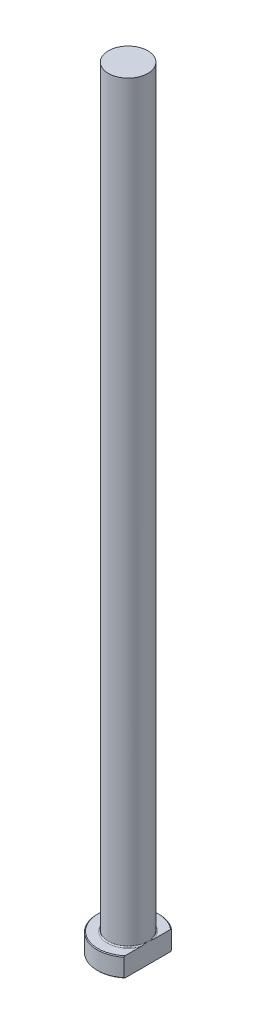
ISO-10303-21;
HEADER;
FILE_DESCRIPTION(('STEP AP214'),'2;1');
FILE_NAME('part.step','',(''),(''),'','','');
FILE_SCHEMA(('AUTOMOTIVE_DESIGN { 1 0 10303 214 1 1 1 1 }'));
ENDSEC;
DATA;
#1=APPLICATION_CONTEXT('core data for automotive mechanical design processes');
#2=APPLICATION_PROTOCOL_DEFINITION('international standard','automotive_design',2000,#1);
#3=PRODUCT_CONTEXT('',#1,'mechanical');
#4=PRODUCT('Part','Part','',(#3));
#5=PRODUCT_RELATED_PRODUCT_CATEGORY('part','',(#4));
#6=PRODUCT_DEFINITION_FORMATION('','',#4);
#7=PRODUCT_DEFINITION_CONTEXT('part definition',#1,'design');
#8=PRODUCT_DEFINITION('design','',#6,#7);
#9=PRODUCT_DEFINITION_SHAPE('','',#8);
#10=(LENGTH_UNIT() NAMED_UNIT(*) SI_UNIT(.MILLI.,.METRE.));
#11=(NAMED_UNIT(*) PLANE_ANGLE_UNIT() SI_UNIT($,.RADIAN.));
#12=(NAMED_UNIT(*) SI_UNIT($,.STERADIAN.) SOLID_ANGLE_UNIT());
#13=UNCERTAINTY_MEASURE_WITH_UNIT(LENGTH_MEASURE(1.E-05),#10,'distance_accuracy_value','');
#14=(GEOMETRIC_REPRESENTATION_CONTEXT(3) GLOBAL_UNCERTAINTY_ASSIGNED_CONTEXT((#13)) GLOBAL_UNIT_ASSIGNED_CONTEXT((#10,
#11,#12)) REPRESENTATION_CONTEXT('',''));
#15=CARTESIAN_POINT('',(0.,0.,0.));
#16=DIRECTION('',(0.,0.,1.));
#17=DIRECTION('',(1.,0.,0.));
#18=AXIS2_PLACEMENT_3D('',#15,#16,#17);
#19=CARTESIAN_POINT('',(0.,0.,0.));
#20=DIRECTION('',(0.,-1.,0.));
#21=DIRECTION('',(0.,0.,-1.));
#22=AXIS2_PLACEMENT_3D('',#19,#20,#21);
#23=PLANE('',#22);
#24=CARTESIAN_POINT('',(0.,0.,0.));
#25=DIRECTION('',(0.,-1.,0.));
#26=DIRECTION('',(0.,0.,-1.));
#27=AXIS2_PLACEMENT_3D('',#24,#25,#26);
#28=CIRCLE('',#27,7.79999999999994);
#29=CARTESIAN_POINT('',(5.09999999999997,0.,5.90169467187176));
#30=VERTEX_POINT('',#29);
#31=CARTESIAN_POINT('',(5.09999999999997,0.,-5.90169467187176));
#32=VERTEX_POINT('',#31);
#33=EDGE_CURVE('E98',#30,#32,#28,.T.);
#34=ORIENTED_EDGE('',*,*,#33,.T.);
#35=DIRECTION('',(0.,0.,1.));
#36=VECTOR('',#35,1.);
#37=CARTESIAN_POINT('',(5.09999999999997,0.,-6.16360284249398));
#38=LINE('',#37,#36);
#39=EDGE_CURVE('E83',#32,#30,#38,.T.);
#40=ORIENTED_EDGE('',*,*,#39,.T.);
#41=EDGE_LOOP('',(#34,#40));
#42=FACE_BOUND('',#41,.T.);
#43=ADVANCED_FACE('F32',(#42),#23,.T.);
#44=CARTESIAN_POINT('',(0.,259.958771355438,0.));
#45=DIRECTION('',(0.,1.,0.));
#46=DIRECTION('',(0.,0.,1.));
#47=AXIS2_PLACEMENT_3D('',#44,#45,#46);
#48=CYLINDRICAL_SURFACE('',#47,7.99999999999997);
#49=CARTESIAN_POINT('',(0.,4.80000000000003,0.));
#50=DIRECTION('',(0.,1.,0.));
#51=DIRECTION('',(0.,0.,1.));
#52=AXIS2_PLACEMENT_3D('',#49,#50,#51);
#53=CIRCLE('',#52,7.99999999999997);
#54=CARTESIAN_POINT('',(5.09999999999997,4.80000000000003,6.16360284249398));
#55=VERTEX_POINT('',#54);
#56=CARTESIAN_POINT('',(5.09999999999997,4.80000000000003,-6.16360284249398));
#57=VERTEX_POINT('',#56);
#58=EDGE_CURVE('E104',#55,#57,#53,.F.);
#59=ORIENTED_EDGE('',*,*,#58,.T.);
#60=DIRECTION('',(0.,-1.,0.));
#61=VECTOR('',#60,1.);
#62=CARTESIAN_POINT('',(5.09999999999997,200.,-6.16360284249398));
#63=LINE('',#62,#61);
#64=CARTESIAN_POINT('',(5.09999999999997,0.200000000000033,-6.16360284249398));
#65=VERTEX_POINT('',#64);
#66=EDGE_CURVE('E183',#57,#65,#63,.T.);
#67=ORIENTED_EDGE('',*,*,#66,.T.);
#68=CARTESIAN_POINT('',(0.,0.200000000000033,0.));
#69=DIRECTION('',(0.,-1.,0.));
#70=DIRECTION('',(0.,0.,-1.));
#71=AXIS2_PLACEMENT_3D('',#68,#69,#70);
#72=CIRCLE('',#71,7.99999999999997);
#73=CARTESIAN_POINT('',(5.09999999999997,0.200000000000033,6.16360284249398));
#74=VERTEX_POINT('',#73);
#75=EDGE_CURVE('E100',#65,#74,#72,.F.);
#76=ORIENTED_EDGE('',*,*,#75,.T.);
#77=DIRECTION('',(0.,-1.,0.));
#78=VECTOR('',#77,1.);
#79=CARTESIAN_POINT('',(5.09999999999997,200.,6.16360284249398));
#80=LINE('',#79,#78);
#81=EDGE_CURVE('E93',#55,#74,#80,.T.);
#82=ORIENTED_EDGE('',*,*,#81,.F.);
#83=EDGE_LOOP('',(#59,#67,#76,#82));
#84=FACE_BOUND('',#83,.T.);
#85=ADVANCED_FACE('F158',(#84),#48,.T.);
#86=CARTESIAN_POINT('',(-7.99999999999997,5.,0.));
#87=DIRECTION('',(0.,1.,0.));
#88=DIRECTION('',(0.,0.,1.));
#89=AXIS2_PLACEMENT_3D('',#86,#87,#88);
#90=PLANE('',#89);
#91=CARTESIAN_POINT('',(0.,5.,0.));
#92=DIRECTION('',(0.,1.,0.));
#93=DIRECTION('',(0.,0.,1.));
#94=AXIS2_PLACEMENT_3D('',#91,#92,#93);
#95=CIRCLE('',#94,7.79999999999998);
#96=CARTESIAN_POINT('',(5.09999999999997,5.,-5.9016946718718));
#97=VERTEX_POINT('',#96);
#98=CARTESIAN_POINT('',(5.09999999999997,5.,5.9016946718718));
#99=VERTEX_POINT('',#98);
#100=EDGE_CURVE('E178',#97,#99,#95,.T.);
#101=ORIENTED_EDGE('',*,*,#100,.T.);
#102=DIRECTION('',(0.,0.,-1.));
#103=VECTOR('',#102,1.);
#104=CARTESIAN_POINT('',(5.09999999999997,5.,0.));
#105=LINE('',#104,#103);
#106=CARTESIAN_POINT('',(5.09999999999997,4.99999999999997,1.77482393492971));
#107=VERTEX_POINT('',#106);
#108=EDGE_CURVE('E57',#99,#107,#105,.T.);
#109=ORIENTED_EDGE('',*,*,#108,.T.);
#110=CARTESIAN_POINT('',(0.,5.,0.));
#111=DIRECTION('',(0.,1.,0.));
#112=DIRECTION('',(0.,0.,1.));
#113=AXIS2_PLACEMENT_3D('',#110,#111,#112);
#114=CIRCLE('',#113,5.39999999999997);
#115=CARTESIAN_POINT('',(5.09999999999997,4.99999999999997,-1.77482393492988));
#116=VERTEX_POINT('',#115);
#117=EDGE_CURVE('E107',#107,#116,#114,.F.);
#118=ORIENTED_EDGE('',*,*,#117,.T.);
#119=EDGE_CURVE('E136',#116,#97,#105,.T.);
#120=ORIENTED_EDGE('',*,*,#119,.T.);
#121=EDGE_LOOP('',(#101,#109,#118,#120));
#122=FACE_BOUND('',#121,.T.);
#123=ADVANCED_FACE('F147',(#122),#90,.T.);
#124=CARTESIAN_POINT('',(0.,5.,0.));
#125=DIRECTION('',(0.,-1.,0.));
#126=DIRECTION('',(0.,0.,-1.));
#127=AXIS2_PLACEMENT_3D('',#124,#125,#126);
#128=CONICAL_SURFACE('',#127,7.79999999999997,0.785398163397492);
#129=ORIENTED_EDGE('',*,*,#58,.F.);
#130=CARTESIAN_POINT('',(5.09999999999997,-1.68838926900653,13.5610996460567));
#131=CARTESIAN_POINT('',(5.09999999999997,-1.49117445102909,13.3503958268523));
#132=CARTESIAN_POINT('',(5.09999999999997,-1.29425912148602,13.1394117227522));
#133=CARTESIAN_POINT('',(5.09999999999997,-0.901124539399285,12.7167935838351));
#134=CARTESIAN_POINT('',(5.09999999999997,-0.704905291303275,12.5051595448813));
#135=CARTESIAN_POINT('',(5.09999999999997,-0.11734269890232,11.8690459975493));
#136=CARTESIAN_POINT('',(5.09999999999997,0.272806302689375,11.4434608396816));
#137=CARTESIAN_POINT('',(5.09999999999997,1.05193640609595,10.5848872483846));
#138=CARTESIAN_POINT('',(5.09999999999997,1.44088225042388,10.1518667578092));
#139=CARTESIAN_POINT('',(5.09999999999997,2.21252525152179,9.28039822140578));
#140=CARTESIAN_POINT('',(5.09999999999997,2.59522339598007,8.84195105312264));
#141=CARTESIAN_POINT('',(5.09999999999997,3.2834654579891,8.03678680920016));
#142=CARTESIAN_POINT('',(5.09999999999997,3.59050446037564,7.67135442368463));
#143=CARTESIAN_POINT('',(5.09999999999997,4.04444149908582,7.1176457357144));
#144=CARTESIAN_POINT('',(5.09999999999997,4.19468098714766,6.93211011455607));
#145=CARTESIAN_POINT('',(5.09999999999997,4.49242146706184,6.55885365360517));
#146=CARTESIAN_POINT('',(5.09999999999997,4.63992249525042,6.37113284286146));
#147=CARTESIAN_POINT('',(5.09999999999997,4.93124846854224,5.99346825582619));
#148=CARTESIAN_POINT('',(5.09999999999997,5.07508033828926,5.80352983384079));
#149=CARTESIAN_POINT('',(5.09999999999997,5.35853965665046,5.42051054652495));
#150=CARTESIAN_POINT('',(5.09999999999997,5.49816682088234,5.22742946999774));
#151=CARTESIAN_POINT('',(5.09999999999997,5.77196390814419,4.83761664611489));
#152=CARTESIAN_POINT('',(5.09999999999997,5.90613746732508,4.64088746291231));
#153=CARTESIAN_POINT('',(5.09999999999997,6.1675386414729,4.24288639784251));
#154=CARTESIAN_POINT('',(5.09999999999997,6.29476755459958,4.0416153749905));
#155=CARTESIAN_POINT('',(5.09999999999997,6.51869473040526,3.6691800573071));
#156=CARTESIAN_POINT('',(5.09999999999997,6.61684568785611,3.49889306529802));
#157=CARTESIAN_POINT('',(5.09999999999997,6.80528626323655,3.15396122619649));
#158=CARTESIAN_POINT('',(5.09999999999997,6.89557493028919,2.97931585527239));
#159=CARTESIAN_POINT('',(5.09999999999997,7.06604933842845,2.62530631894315));
#160=CARTESIAN_POINT('',(5.09999999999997,7.14624387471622,2.44594642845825));
#161=CARTESIAN_POINT('',(5.09999999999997,7.29389284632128,2.08202755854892));
#162=CARTESIAN_POINT('',(5.09999999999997,7.36135077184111,1.89747001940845));
#163=CARTESIAN_POINT('',(5.09999999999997,7.46787946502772,1.56242413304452));
#164=CARTESIAN_POINT('',(5.09999999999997,7.50993657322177,1.41289089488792));
#165=CARTESIAN_POINT('',(5.09999999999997,7.58244227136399,1.11101527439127));
#166=CARTESIAN_POINT('',(5.09999999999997,7.61289239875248,0.958673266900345));
#167=CARTESIAN_POINT('',(5.09999999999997,7.66066060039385,0.652384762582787));
#168=CARTESIAN_POINT('',(5.09999999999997,7.67801796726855,0.498444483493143));
#169=CARTESIAN_POINT('',(5.09999999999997,7.69880109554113,0.18961690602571));
#170=CARTESIAN_POINT('',(5.09999999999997,7.70222744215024,0.034729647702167));
#171=CARTESIAN_POINT('',(5.09999999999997,7.69494415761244,-0.274953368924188));
#172=CARTESIAN_POINT('',(5.09999999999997,7.68421202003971,-0.429748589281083));
#173=CARTESIAN_POINT('',(5.09999999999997,7.64918519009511,-0.73778421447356));
#174=CARTESIAN_POINT('',(5.09999999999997,7.62488939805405,-0.891024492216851));
#175=CARTESIAN_POINT('',(5.09999999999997,7.56389278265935,-1.19546940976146));
#176=CARTESIAN_POINT('',(5.09999999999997,7.52715417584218,-1.34666637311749));
#177=CARTESIAN_POINT('',(5.09999999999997,7.44288917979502,-1.64598767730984));
#178=CARTESIAN_POINT('',(5.09999999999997,7.39536249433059,-1.79411193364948));
#179=CARTESIAN_POINT('',(5.09999999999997,7.28286361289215,-2.110452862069));
#180=CARTESIAN_POINT('',(5.09999999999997,7.21631794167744,-2.27810587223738));
#181=CARTESIAN_POINT('',(5.09999999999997,7.07327742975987,-2.60914825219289));
#182=CARTESIAN_POINT('',(5.09999999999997,6.99677812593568,-2.77253566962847));
#183=CARTESIAN_POINT('',(5.09999999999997,6.83568399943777,-3.09559415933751));
#184=CARTESIAN_POINT('',(5.09999999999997,6.75107532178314,-3.25525827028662));
#185=CARTESIAN_POINT('',(5.09999999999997,6.57547395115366,-3.57098467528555));
#186=CARTESIAN_POINT('',(5.09999999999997,6.48448213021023,-3.72704745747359));
#187=CARTESIAN_POINT('',(5.09999999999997,6.29613682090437,-4.03803676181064));
#188=CARTESIAN_POINT('',(5.09999999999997,6.19871627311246,-4.1929224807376));
#189=CARTESIAN_POINT('',(5.09999999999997,5.99959202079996,-4.49991023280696));
#190=CARTESIAN_POINT('',(5.09999999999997,5.89788820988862,-4.65201219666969));
#191=CARTESIAN_POINT('',(5.09999999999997,5.69108681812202,-4.95365388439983));
#192=CARTESIAN_POINT('',(5.09999999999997,5.58599284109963,-5.10319608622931));
#193=CARTESIAN_POINT('',(5.09999999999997,5.37292107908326,-5.40020343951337));
#194=CARTESIAN_POINT('',(5.09999999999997,5.2649433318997,-5.54766861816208));
#195=CARTESIAN_POINT('',(5.09999999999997,5.021788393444,-5.87409503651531));
#196=CARTESIAN_POINT('',(5.09999999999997,4.88600343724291,-6.05260304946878));
#197=CARTESIAN_POINT('',(5.09999999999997,4.61149829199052,-6.40735082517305));
#198=CARTESIAN_POINT('',(5.09999999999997,4.47277800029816,-6.58359050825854));
#199=CARTESIAN_POINT('',(5.09999999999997,4.05300130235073,-7.10948762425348));
#200=CARTESIAN_POINT('',(5.09999999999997,3.7683596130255,-7.45628264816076));
#201=CARTESIAN_POINT('',(5.09999999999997,3.19218529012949,-8.14465597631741));
#202=CARTESIAN_POINT('',(5.09999999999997,2.90064601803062,-8.48622868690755));
#203=CARTESIAN_POINT('',(5.09999999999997,2.31275375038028,-9.16521513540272));
#204=CARTESIAN_POINT('',(5.09999999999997,2.01640062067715,-9.50262875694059));
#205=CARTESIAN_POINT('',(5.09999999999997,1.43877149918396,-10.1532482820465));
#206=CARTESIAN_POINT('',(5.09999999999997,1.15771277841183,-10.4666475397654));
#207=CARTESIAN_POINT('',(5.09999999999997,0.593133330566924,-11.0912313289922));
#208=CARTESIAN_POINT('',(5.09999999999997,0.309612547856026,-11.4024158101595));
#209=CARTESIAN_POINT('',(5.09999999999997,-0.258772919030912,-12.0223487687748));
#210=CARTESIAN_POINT('',(5.09999999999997,-0.54363352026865,-12.3311009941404));
#211=CARTESIAN_POINT('',(5.09999999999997,-1.1149217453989,-12.9471274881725));
#212=CARTESIAN_POINT('',(5.09999999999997,-1.40134929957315,-13.2544018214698));
#213=CARTESIAN_POINT('',(5.09999999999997,-1.68838926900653,-13.5610996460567));
#214=B_SPLINE_CURVE_WITH_KNOTS('',3,(#130,#131,#132,#133,#134,#135,#136,#137,#138,#139,#140,
#141,#142,#143,#144,#145,#146,#147,#148,#149,#150,#151,#152,#153,#154,#155,#156,#157,#158,#159,
#160,#161,#162,#163,#164,#165,#166,#167,#168,#169,#170,#171,#172,#173,#174,#175,#176,#177,#178,
#179,#180,#181,#182,#183,#184,#185,#186,#187,#188,#189,#190,#191,#192,#193,#194,#195,#196,#197,
#198,#199,#200,#201,#202,#203,#204,#205,#206,#207,#208,#209,#210,#211,#212,#213),.UNSPECIFIED.,
.F.,.F.,(4,2,2,2,2,2,2,2,2,2,2,2,2,2,2,2,2,2,2,2,2,2,2,2,2,2,2,2,2,2,2,2,2,2,2,2,2,2,2,2,2,4),
(0.,0.865798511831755,1.73160254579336,3.4636456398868,5.20976443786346,6.95560446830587,
8.38738766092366,9.10357880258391,9.81976043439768,10.5344719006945,11.249231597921,
11.9635066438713,12.677647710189,13.2671324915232,13.8566884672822,14.4457271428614,
15.0346041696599,15.5002159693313,15.9657660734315,16.4299133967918,16.8940412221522,
17.3589077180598,17.8238119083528,18.2901406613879,18.7564822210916,19.2972067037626,
19.838174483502,20.3800835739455,20.921918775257,21.470762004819,22.01961887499,
22.5679103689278,23.1161946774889,23.7890028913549,24.4618346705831,25.807650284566,
27.1548185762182,28.5020244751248,29.7649097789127,31.0278236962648,32.2880803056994,
33.5482812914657),.UNSPECIFIED.);
#215=EDGE_CURVE('E135',#55,#99,#214,.T.);
#216=ORIENTED_EDGE('',*,*,#215,.T.);
#217=ORIENTED_EDGE('',*,*,#100,.F.);
#218=EDGE_CURVE('E127',#97,#57,#214,.T.);
#219=ORIENTED_EDGE('',*,*,#218,.T.);
#220=EDGE_LOOP('',(#129,#216,#217,#219));
#221=FACE_BOUND('',#220,.T.);
#222=ADVANCED_FACE('F143',(#221),#128,.T.);
#223=CARTESIAN_POINT('',(0.,0.200000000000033,0.));
#224=DIRECTION('',(0.,1.,0.));
#225=DIRECTION('',(0.,0.,1.));
#226=AXIS2_PLACEMENT_3D('',#223,#224,#225);
#227=CONICAL_SURFACE('',#226,7.99999999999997,0.785398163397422);
#228=ORIENTED_EDGE('',*,*,#75,.F.);
#229=CARTESIAN_POINT('',(5.09999999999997,6.68838926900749,-13.5610996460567));
#230=CARTESIAN_POINT('',(5.09999999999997,6.49117445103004,-13.3503958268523));
#231=CARTESIAN_POINT('',(5.09999999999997,6.29425912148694,-13.1394117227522));
#232=CARTESIAN_POINT('',(5.09999999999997,5.90112453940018,-12.7167935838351));
#233=CARTESIAN_POINT('',(5.09999999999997,5.70490529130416,-12.5051595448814));
#234=CARTESIAN_POINT('',(5.09999999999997,5.11734269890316,-11.8690459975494));
#235=CARTESIAN_POINT('',(5.09999999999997,4.72719369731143,-11.4434608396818));
#236=CARTESIAN_POINT('',(5.09999999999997,3.9480635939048,-10.5848872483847));
#237=CARTESIAN_POINT('',(5.09999999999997,3.55911774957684,-10.1518667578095));
#238=CARTESIAN_POINT('',(5.09999999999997,2.78747474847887,-9.28039822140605));
#239=CARTESIAN_POINT('',(5.09999999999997,2.40477660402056,-8.84195105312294));
#240=CARTESIAN_POINT('',(5.09999999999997,1.71653454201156,-8.03678680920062));
#241=CARTESIAN_POINT('',(5.09999999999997,1.40949553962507,-7.6713544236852));
#242=CARTESIAN_POINT('',(5.09999999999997,0.955558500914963,-7.11764573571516));
#243=CARTESIAN_POINT('',(5.09999999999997,0.805319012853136,-6.93211011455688));
#244=CARTESIAN_POINT('',(5.09999999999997,0.50757853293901,-6.55885365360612));
#245=CARTESIAN_POINT('',(5.09999999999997,0.36007750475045,-6.37113284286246));
#246=CARTESIAN_POINT('',(5.09999999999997,0.0687515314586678,-5.99346825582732));
#247=CARTESIAN_POINT('',(5.09999999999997,-0.0750803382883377,-5.80352983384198));
#248=CARTESIAN_POINT('',(5.09999999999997,-0.358539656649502,-5.42051054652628));
#249=CARTESIAN_POINT('',(5.09999999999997,-0.498166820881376,-5.22742946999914));
#250=CARTESIAN_POINT('',(5.09999999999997,-0.771963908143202,-4.83761664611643));
#251=CARTESIAN_POINT('',(5.09999999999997,-0.906137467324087,-4.64088746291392));
#252=CARTESIAN_POINT('',(5.09999999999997,-1.1675386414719,-4.24288639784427));
#253=CARTESIAN_POINT('',(5.09999999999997,-1.29476755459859,-4.04161537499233));
#254=CARTESIAN_POINT('',(5.09999999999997,-1.51869473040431,-3.66918005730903));
#255=CARTESIAN_POINT('',(5.09999999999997,-1.6168456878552,-3.49889306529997));
#256=CARTESIAN_POINT('',(5.09999999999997,-1.80528626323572,-3.15396122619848));
#257=CARTESIAN_POINT('',(5.09999999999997,-1.8955749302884,-2.9793158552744));
#258=CARTESIAN_POINT('',(5.09999999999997,-2.06604933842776,-2.62530631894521));
#259=CARTESIAN_POINT('',(5.09999999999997,-2.14624387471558,-2.44594642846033));
#260=CARTESIAN_POINT('',(5.09999999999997,-2.29389284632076,-2.08202755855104));
#261=CARTESIAN_POINT('',(5.09999999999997,-2.36135077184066,-1.8974700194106));
#262=CARTESIAN_POINT('',(5.09999999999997,-2.4678794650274,-1.56242413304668));
#263=CARTESIAN_POINT('',(5.09999999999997,-2.5099365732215,-1.41289089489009));
#264=CARTESIAN_POINT('',(5.09999999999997,-2.58244227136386,-1.11101527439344));
#265=CARTESIAN_POINT('',(5.09999999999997,-2.61289239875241,-0.958673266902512));
#266=CARTESIAN_POINT('',(5.09999999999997,-2.66066060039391,-0.652384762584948));
#267=CARTESIAN_POINT('',(5.09999999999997,-2.67801796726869,-0.498444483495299));
#268=CARTESIAN_POINT('',(5.09999999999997,-2.6988010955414,-0.18961690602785));
#269=CARTESIAN_POINT('',(5.09999999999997,-2.70222744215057,-0.0347296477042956));
#270=CARTESIAN_POINT('',(5.09999999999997,-2.6949441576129,0.274953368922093));
#271=CARTESIAN_POINT('',(5.09999999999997,-2.68421202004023,0.429748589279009));
#272=CARTESIAN_POINT('',(5.09999999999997,-2.64918519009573,0.737784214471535));
#273=CARTESIAN_POINT('',(5.09999999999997,-2.62488939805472,0.891024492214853));
#274=CARTESIAN_POINT('',(5.09999999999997,-2.56389278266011,1.19546940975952));
#275=CARTESIAN_POINT('',(5.09999999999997,-2.52715417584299,1.34666637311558));
#276=CARTESIAN_POINT('',(5.09999999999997,-2.4428891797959,1.64598767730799));
#277=CARTESIAN_POINT('',(5.09999999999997,-2.3953624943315,1.79411193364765));
#278=CARTESIAN_POINT('',(5.09999999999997,-2.28286361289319,2.11045286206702));
#279=CARTESIAN_POINT('',(5.09999999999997,-2.2163179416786,2.27810587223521));
#280=CARTESIAN_POINT('',(5.09999999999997,-2.07327742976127,2.60914825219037));
#281=CARTESIAN_POINT('',(5.09999999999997,-1.9967781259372,2.77253566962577));
#282=CARTESIAN_POINT('',(5.09999999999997,-1.83568399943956,3.09559415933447));
#283=CARTESIAN_POINT('',(5.09999999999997,-1.75107532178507,3.25525827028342));
#284=CARTESIAN_POINT('',(5.09999999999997,-1.57547395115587,3.57098467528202));
#285=CARTESIAN_POINT('',(5.09999999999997,-1.48448213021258,3.72704745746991));
#286=CARTESIAN_POINT('',(5.09999999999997,-1.29613682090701,4.03803676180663));
#287=CARTESIAN_POINT('',(5.09999999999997,-1.19871627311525,4.19292248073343));
#288=CARTESIAN_POINT('',(5.09999999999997,-0.999592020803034,4.49991023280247));
#289=CARTESIAN_POINT('',(5.09999999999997,-0.897888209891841,4.65201219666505));
#290=CARTESIAN_POINT('',(5.09999999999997,-0.691086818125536,4.95365388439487));
#291=CARTESIAN_POINT('',(5.09999999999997,-0.5859928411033,5.10319608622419));
#292=CARTESIAN_POINT('',(5.09999999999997,-0.37292107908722,5.40020343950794));
#293=CARTESIAN_POINT('',(5.09999999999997,-0.264943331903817,5.54766861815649));
#294=CARTESIAN_POINT('',(5.09999999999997,-0.0217883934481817,5.87409503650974));
#295=CARTESIAN_POINT('',(5.09999999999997,0.113996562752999,6.05260304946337));
#296=CARTESIAN_POINT('',(5.09999999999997,0.388501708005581,6.40735082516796));
#297=CARTESIAN_POINT('',(5.09999999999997,0.527221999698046,6.5835905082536));
#298=CARTESIAN_POINT('',(5.09999999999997,0.946998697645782,7.10948762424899));
#299=CARTESIAN_POINT('',(5.09999999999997,1.23164038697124,7.45628264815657));
#300=CARTESIAN_POINT('',(5.09999999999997,1.80781470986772,8.14465597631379));
#301=CARTESIAN_POINT('',(5.09999999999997,2.09935398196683,8.48622868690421));
#302=CARTESIAN_POINT('',(5.09999999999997,2.68724624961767,9.16521513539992));
#303=CARTESIAN_POINT('',(5.09999999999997,2.98359937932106,9.50262875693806));
#304=CARTESIAN_POINT('',(5.09999999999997,3.56122850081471,10.1532482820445));
#305=CARTESIAN_POINT('',(5.09999999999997,3.84228722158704,10.4666475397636));
#306=CARTESIAN_POINT('',(5.09999999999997,4.40686666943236,11.0912313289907));
#307=CARTESIAN_POINT('',(5.09999999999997,4.69038745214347,11.4024158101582));
#308=CARTESIAN_POINT('',(5.09999999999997,5.25877291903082,12.0223487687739));
#309=CARTESIAN_POINT('',(5.09999999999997,5.54363352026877,12.3311009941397));
#310=CARTESIAN_POINT('',(5.09999999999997,6.11492174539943,12.9471274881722));
#311=CARTESIAN_POINT('',(5.09999999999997,6.40134929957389,13.2544018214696));
#312=CARTESIAN_POINT('',(5.09999999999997,6.68838926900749,13.5610996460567));
#313=B_SPLINE_CURVE_WITH_KNOTS('',3,(#229,#230,#231,#232,#233,#234,#235,#236,#237,#238,#239,
#240,#241,#242,#243,#244,#245,#246,#247,#248,#249,#250,#251,#252,#253,#254,#255,#256,#257,#258,
#259,#260,#261,#262,#263,#264,#265,#266,#267,#268,#269,#270,#271,#272,#273,#274,#275,#276,#277,
#278,#279,#280,#281,#282,#283,#284,#285,#286,#287,#288,#289,#290,#291,#292,#293,#294,#295,#296,
#297,#298,#299,#300,#301,#302,#303,#304,#305,#306,#307,#308,#309,#310,#311,#312),.UNSPECIFIED.,
.F.,.F.,(4,2,2,2,2,2,2,2,2,2,2,2,2,2,2,2,2,2,2,2,2,2,2,2,2,2,2,2,2,2,2,2,2,2,2,2,2,2,2,2,2,4),
(0.,0.865798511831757,1.73160254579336,3.46364563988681,5.20976443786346,6.95560446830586,
8.38738766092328,9.10357880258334,9.81976043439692,10.5344719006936,11.2492315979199,
11.96350664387,12.6776477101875,13.2671324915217,13.8566884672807,14.4457271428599,
15.0346041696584,15.5002159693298,15.9657660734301,16.4299133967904,16.8940412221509,
17.3589077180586,17.8238119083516,18.2901406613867,18.7564822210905,19.2972067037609,
19.8381744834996,20.3800835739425,20.9219187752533,21.4707620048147,22.019618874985,
22.5679103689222,23.1161946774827,23.7890028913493,24.461834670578,25.807650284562,
27.1548185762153,28.502024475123,29.7649097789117,31.0278236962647,32.2880803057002,
33.5482812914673),.UNSPECIFIED.);
#314=EDGE_CURVE('E86',#65,#32,#313,.T.);
#315=ORIENTED_EDGE('',*,*,#314,.T.);
#316=ORIENTED_EDGE('',*,*,#33,.F.);
#317=EDGE_CURVE('E89',#30,#74,#313,.T.);
#318=ORIENTED_EDGE('',*,*,#317,.T.);
#319=EDGE_LOOP('',(#228,#315,#316,#318));
#320=FACE_BOUND('',#319,.T.);
#321=ADVANCED_FACE('F97',(#320),#227,.T.);
#322=CARTESIAN_POINT('',(0.,5.29999999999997,0.));
#323=DIRECTION('',(0.,1.,0.));
#324=DIRECTION('',(0.,0.,1.));
#325=AXIS2_PLACEMENT_3D('',#322,#323,#324);
#326=TOROIDAL_SURFACE('',#325,5.39999999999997,0.3);
#327=CARTESIAN_POINT('',(5.09999999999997,5.29999999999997,0.));
#328=CARTESIAN_POINT('',(5.09999999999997,5.30000062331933,1.00502423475E-10));
#329=CARTESIAN_POINT('',(5.09999999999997,5.30000124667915,-2.56272245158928E-07));
#330=CARTESIAN_POINT('',(5.09999999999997,5.30000240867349,-9.58155656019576E-07));
#331=CARTESIAN_POINT('',(5.09999999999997,5.30000293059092,-1.42128215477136E-06));
#332=CARTESIAN_POINT('',(5.09999999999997,5.30000402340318,-2.53262703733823E-06));
#333=CARTESIAN_POINT('',(5.09999999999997,5.30000457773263,-3.19888436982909E-06));
#334=CARTESIAN_POINT('',(5.09999999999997,5.30000556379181,-4.57422758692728E-06));
#335=CARTESIAN_POINT('',(5.09999999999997,5.30000599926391,-5.28085592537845E-06));
#336=CARTESIAN_POINT('',(5.09999999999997,5.30000763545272,-8.04031793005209E-06));
#337=CARTESIAN_POINT('',(5.09999999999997,5.30000874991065,-1.01478584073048E-05));
#338=CARTESIAN_POINT('',(5.09999999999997,5.30001056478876,-1.43037796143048E-05));
#339=CARTESIAN_POINT('',(5.09999999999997,5.30001129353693,-1.6340275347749E-05));
#340=CARTESIAN_POINT('',(5.09999999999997,5.30001438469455,-2.50239477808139E-05));
#341=CARTESIAN_POINT('',(5.09999999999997,5.30001671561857,-3.168576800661E-05));
#342=CARTESIAN_POINT('',(5.09999999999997,5.30002011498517,-4.42245824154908E-05));
#343=CARTESIAN_POINT('',(5.09999999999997,5.30002132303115,-5.00633656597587E-05));
#344=CARTESIAN_POINT('',(5.09999999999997,5.30003017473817,-9.36444945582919E-05));
#345=CARTESIAN_POINT('',(5.09999999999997,5.30003694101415,-0.00013150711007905));
#346=CARTESIAN_POINT('',(5.09999999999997,5.30006656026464,-0.000281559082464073));
#347=CARTESIAN_POINT('',(5.09999999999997,5.30009476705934,-0.000392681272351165));
#348=CARTESIAN_POINT('',(5.09999999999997,5.30020497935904,-0.000834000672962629));
#349=CARTESIAN_POINT('',(5.09999999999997,5.30028356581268,-0.00116477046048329));
#350=CARTESIAN_POINT('',(5.09999999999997,5.30059910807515,-0.00248331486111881));
#351=CARTESIAN_POINT('',(5.09999999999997,5.30084040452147,-0.00347033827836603));
#352=CARTESIAN_POINT('',(5.09999999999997,5.30184681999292,-0.00759777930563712));
#353=CARTESIAN_POINT('',(5.09999999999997,5.30260646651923,-0.0107391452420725));
#354=CARTESIAN_POINT('',(5.09999999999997,5.30990583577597,-0.0409103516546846));
#355=CARTESIAN_POINT('',(5.09999999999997,5.31647007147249,-0.0679360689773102));
#356=CARTESIAN_POINT('',(5.09999999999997,5.32929459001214,-0.120902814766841));
#357=CARTESIAN_POINT('',(5.09999999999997,5.3355564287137,-0.146843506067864));
#358=CARTESIAN_POINT('',(5.09999999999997,5.3488421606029,-0.202060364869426));
#359=CARTESIAN_POINT('',(5.09999999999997,5.35586083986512,-0.231337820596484));
#360=CARTESIAN_POINT('',(5.09999999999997,5.36989412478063,-0.290236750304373));
#361=CARTESIAN_POINT('',(5.09999999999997,5.37690782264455,-0.319858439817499));
#362=CARTESIAN_POINT('',(5.09999999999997,5.39370531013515,-0.391396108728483));
#363=CARTESIAN_POINT('',(5.09999999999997,5.40343385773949,-0.433325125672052));
#364=CARTESIAN_POINT('',(5.09999999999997,5.42233571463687,-0.516161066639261));
#365=CARTESIAN_POINT('',(5.09999999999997,5.43151688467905,-0.55706619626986));
#366=CARTESIAN_POINT('',(5.09999999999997,5.45452080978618,-0.66177738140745));
#367=CARTESIAN_POINT('',(5.09999999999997,5.46807892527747,-0.725642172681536));
#368=CARTESIAN_POINT('',(5.09999999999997,5.4940673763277,-0.854162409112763));
#369=CARTESIAN_POINT('',(5.09999999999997,5.5064872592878,-0.918819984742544));
#370=CARTESIAN_POINT('',(5.09999999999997,5.53078685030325,-1.05464624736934));
#371=CARTESIAN_POINT('',(5.09999999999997,5.5425007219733,-1.12584508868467));
#372=CARTESIAN_POINT('',(5.09999999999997,5.56331904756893,-1.26861848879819));
#373=CARTESIAN_POINT('',(5.09999999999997,5.57242395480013,-1.34019298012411));
#374=CARTESIAN_POINT('',(5.09999999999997,5.58708832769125,-1.48237032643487));
#375=CARTESIAN_POINT('',(5.09999999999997,5.59271078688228,-1.55296638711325));
#376=CARTESIAN_POINT('',(5.09999999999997,5.59964105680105,-1.69455989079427));
#377=CARTESIAN_POINT('',(5.09999999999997,5.60093824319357,-1.76555789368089));
#378=CARTESIAN_POINT('',(5.09999999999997,5.59769411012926,-1.90544222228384));
#379=CARTESIAN_POINT('',(5.09999999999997,5.59332114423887,-1.97433003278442));
#380=CARTESIAN_POINT('',(5.09999999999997,5.58075096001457,-2.07681569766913));
#381=CARTESIAN_POINT('',(5.09999999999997,5.57557260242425,-2.11078113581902));
#382=CARTESIAN_POINT('',(5.09999999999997,5.56270516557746,-2.17822373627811));
#383=CARTESIAN_POINT('',(5.09999999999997,5.55501865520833,-2.21170136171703));
#384=CARTESIAN_POINT('',(5.09999999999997,5.54146504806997,-2.25971093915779));
#385=CARTESIAN_POINT('',(5.09999999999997,5.53689562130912,-2.27460808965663));
#386=CARTESIAN_POINT('',(5.09999999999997,5.52697250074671,-2.30414012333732));
#387=CARTESIAN_POINT('',(5.09999999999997,5.52161846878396,-2.31877489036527));
#388=CARTESIAN_POINT('',(5.09999999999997,5.50422688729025,-2.36209889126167));
#389=CARTESIAN_POINT('',(5.09999999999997,5.49083502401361,-2.3903019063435));
#390=CARTESIAN_POINT('',(5.09999999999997,5.46786086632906,-2.42877296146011));
#391=CARTESIAN_POINT('',(5.09999999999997,5.4603260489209,-2.44026309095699));
#392=CARTESIAN_POINT('',(5.09999999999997,5.44403681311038,-2.46240090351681));
#393=CARTESIAN_POINT('',(5.09999999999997,5.43527992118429,-2.47304680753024));
#394=CARTESIAN_POINT('',(5.09999999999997,5.41620529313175,-2.49317992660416));
#395=CARTESIAN_POINT('',(5.09999999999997,5.40586565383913,-2.50264683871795));
#396=CARTESIAN_POINT('',(5.09999999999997,5.3835690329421,-2.5194267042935));
#397=CARTESIAN_POINT('',(5.09999999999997,5.37162091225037,-2.5267508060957));
#398=CARTESIAN_POINT('',(5.09999999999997,5.35166538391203,-2.53574339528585));
#399=CARTESIAN_POINT('',(5.09999999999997,5.34414545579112,-2.53849221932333));
#400=CARTESIAN_POINT('',(5.09999999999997,5.32875362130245,-2.5427156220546));
#401=CARTESIAN_POINT('',(5.09999999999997,5.32088204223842,-2.5441913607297));
#402=CARTESIAN_POINT('',(5.09999999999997,5.30496570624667,-2.54573009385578));
#403=CARTESIAN_POINT('',(5.09999999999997,5.29692036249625,-2.54578715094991));
#404=CARTESIAN_POINT('',(5.09999999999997,5.28094771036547,-2.54446730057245));
#405=CARTESIAN_POINT('',(5.09999999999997,5.27302044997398,-2.54308982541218));
#406=CARTESIAN_POINT('',(5.09999999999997,5.25787452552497,-2.53913219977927));
#407=CARTESIAN_POINT('',(5.09999999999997,5.25064005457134,-2.53661104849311));
#408=CARTESIAN_POINT('',(5.09999999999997,5.23660403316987,-2.53057544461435));
#409=CARTESIAN_POINT('',(5.09999999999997,5.22980263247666,-2.52706065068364));
#410=CARTESIAN_POINT('',(5.09999999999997,5.21241680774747,-2.51668428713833));
#411=CARTESIAN_POINT('',(5.09999999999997,5.20224553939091,-2.50913195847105));
#412=CARTESIAN_POINT('',(5.09999999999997,5.18317971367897,-2.49255314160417));
#413=CARTESIAN_POINT('',(5.09999999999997,5.17428964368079,-2.48352169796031));
#414=CARTESIAN_POINT('',(5.09999999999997,5.15120222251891,-2.45711400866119));
#415=CARTESIAN_POINT('',(5.09999999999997,5.13821905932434,-2.43868687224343));
#416=CARTESIAN_POINT('',(5.09999999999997,5.11496748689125,-2.40025423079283));
#417=CARTESIAN_POINT('',(5.09999999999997,5.1047025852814,-2.38024672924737));
#418=CARTESIAN_POINT('',(5.09999999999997,5.0855950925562,-2.33784185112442));
#419=CARTESIAN_POINT('',(5.09999999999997,5.07690690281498,-2.31537591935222));
#420=CARTESIAN_POINT('',(5.09999999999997,5.06139749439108,-2.26979738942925));
#421=CARTESIAN_POINT('',(5.09999999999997,5.05457848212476,-2.24668406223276));
#422=CARTESIAN_POINT('',(5.09999999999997,5.04239975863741,-2.1998307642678));
#423=CARTESIAN_POINT('',(5.09999999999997,5.03705561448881,-2.17608680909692));
#424=CARTESIAN_POINT('',(5.09999999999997,5.02766167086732,-2.12836719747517));
#425=CARTESIAN_POINT('',(5.09999999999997,5.02361095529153,-2.10439171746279));
#426=CARTESIAN_POINT('',(5.09999999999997,5.01439130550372,-2.04113234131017));
#427=CARTESIAN_POINT('',(5.09999999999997,5.01012481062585,-2.00171697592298));
#428=CARTESIAN_POINT('',(5.09999999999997,5.00388663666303,-1.92269917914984));
#429=CARTESIAN_POINT('',(5.09999999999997,5.00191621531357,-1.88309665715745));
#430=CARTESIAN_POINT('',(5.09999999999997,4.99879803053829,-1.76395655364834));
#431=CARTESIAN_POINT('',(5.09999999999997,5.00047462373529,-1.68434528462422));
#432=CARTESIAN_POINT('',(5.09999999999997,5.00888754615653,-1.52975473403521));
#433=CARTESIAN_POINT('',(5.09999999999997,5.01534627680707,-1.45475708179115));
#434=CARTESIAN_POINT('',(5.09999999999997,5.0317664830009,-1.30572790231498));
#435=CARTESIAN_POINT('',(5.09999999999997,5.04170115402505,-1.23169335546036));
#436=CARTESIAN_POINT('',(5.09999999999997,5.06541265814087,-1.07626149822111));
#437=CARTESIAN_POINT('',(5.09999999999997,5.07948398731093,-0.994910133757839));
#438=CARTESIAN_POINT('',(5.09999999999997,5.10254680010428,-0.872231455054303));
#439=CARTESIAN_POINT('',(5.09999999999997,5.11066831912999,-0.830736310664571));
#440=CARTESIAN_POINT('',(5.09999999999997,5.12745388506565,-0.747740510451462));
#441=CARTESIAN_POINT('',(5.09999999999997,5.1361193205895,-0.706240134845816));
#442=CARTESIAN_POINT('',(5.09999999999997,5.15735306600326,-0.607104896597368));
#443=CARTESIAN_POINT('',(5.09999999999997,5.17012138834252,-0.549513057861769));
#444=CARTESIAN_POINT('',(5.09999999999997,5.19610836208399,-0.435113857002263));
#445=CARTESIAN_POINT('',(5.09999999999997,5.20932032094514,-0.378304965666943));
#446=CARTESIAN_POINT('',(5.09999999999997,5.23456914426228,-0.271298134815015));
#447=CARTESIAN_POINT('',(5.09999999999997,5.24656654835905,-0.22109077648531));
#448=CARTESIAN_POINT('',(5.09999999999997,5.27126433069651,-0.118550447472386));
#449=CARTESIAN_POINT('',(5.09999999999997,5.28397269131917,-0.0662193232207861));
#450=CARTESIAN_POINT('',(5.09999999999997,5.29739466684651,-0.0107340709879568));
#451=CARTESIAN_POINT('',(5.09999999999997,5.29815561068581,-0.00758765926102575));
#452=CARTESIAN_POINT('',(5.09999999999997,5.29916232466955,-0.00345908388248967));
#453=CARTESIAN_POINT('',(5.09999999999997,5.29940265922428,-0.00247597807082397));
#454=CARTESIAN_POINT('',(5.09999999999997,5.2997170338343,-0.00116231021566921));
#455=CARTESIAN_POINT('',(5.09999999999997,5.29979539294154,-0.000832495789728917));
#456=CARTESIAN_POINT('',(5.09999999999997,5.29990533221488,-0.000392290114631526));
#457=CARTESIAN_POINT('',(5.09999999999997,5.29993350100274,-0.000281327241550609));
#458=CARTESIAN_POINT('',(5.09999999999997,5.29996308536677,-0.000131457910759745));
#459=CARTESIAN_POINT('',(5.09999999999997,5.29996984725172,-9.36171898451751E-05));
#460=CARTESIAN_POINT('',(5.09999999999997,5.29997868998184,-5.00584682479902E-05));
#461=CARTESIAN_POINT('',(5.09999999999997,5.29997989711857,-4.42208592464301E-05));
#462=CARTESIAN_POINT('',(5.09999999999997,5.29998329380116,-3.16844912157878E-05));
#463=CARTESIAN_POINT('',(5.09999999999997,5.29998562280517,-2.50238809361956E-05));
#464=CARTESIAN_POINT('',(5.09999999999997,5.29998871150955,-1.63414750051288E-05));
#465=CARTESIAN_POINT('',(5.09999999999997,5.29998943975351,-1.43050668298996E-05));
#466=CARTESIAN_POINT('',(5.09999999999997,5.29999125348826,-1.0149241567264E-05));
#467=CARTESIAN_POINT('',(5.09999999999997,5.29999236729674,-8.04169787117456E-06));
#468=CARTESIAN_POINT('',(5.09999999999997,5.29999400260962,-5.28214008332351E-06));
#469=CARTESIAN_POINT('',(5.09999999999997,5.29999443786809,-4.57545909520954E-06));
#470=CARTESIAN_POINT('',(5.09999999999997,5.29999542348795,-3.19997201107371E-06));
#471=CARTESIAN_POINT('',(5.09999999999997,5.29999597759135,-2.53362183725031E-06));
#472=CARTESIAN_POINT('',(5.09999999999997,5.29999707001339,-1.42206069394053E-06));
#473=CARTESIAN_POINT('',(5.09999999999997,5.2999975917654,-9.58819426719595E-07));
#474=CARTESIAN_POINT('',(5.09999999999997,5.29999875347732,-2.56643126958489E-07));
#475=CARTESIAN_POINT('',(5.09999999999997,5.29999937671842,-1.00496326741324E-10));
#476=CARTESIAN_POINT('',(5.09999999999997,5.29999999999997,0.));
#477=B_SPLINE_CURVE_WITH_KNOTS('',3,(#327,#328,#329,#330,#331,#332,#333,#334,#335,#336,#337,
#338,#339,#340,#341,#342,#343,#344,#345,#346,#347,#348,#349,#350,#351,#352,#353,#354,#355,#356,
#357,#358,#359,#360,#361,#362,#363,#364,#365,#366,#367,#368,#369,#370,#371,#372,#373,#374,#375,
#376,#377,#378,#379,#380,#381,#382,#383,#384,#385,#386,#387,#388,#389,#390,#391,#392,#393,#394,
#395,#396,#397,#398,#399,#400,#401,#402,#403,#404,#405,#406,#407,#408,#409,#410,#411,#412,#413,
#414,#415,#416,#417,#418,#419,#420,#421,#422,#423,#424,#425,#426,#427,#428,#429,#430,#431,#432,
#433,#434,#435,#436,#437,#438,#439,#440,#441,#442,#443,#444,#445,#446,#447,#448,#449,#450,#451,
#452,#453,#454,#455,#456,#457,#458,#459,#460,#461,#462,#463,#464,#465,#466,#467,#468,#469,#470,
#471,#472,#473,#474,#475,#476),.UNSPECIFIED.,.T.,.F.,(4,2,2,2,2,2,2,2,2,2,2,2,2,2,2,2,2,2,2,2,2,
2,2,2,2,2,2,2,2,2,2,2,2,2,2,2,2,2,2,2,2,2,2,2,2,2,2,2,2,2,2,2,2,2,2,2,2,2,2,2,2,2,2,2,2,2,2,2,2,
2,2,2,2,2,4),(0.,1.89160361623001E-06,3.99004217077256E-06,6.57353786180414E-06,
9.06254730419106E-06,1.61899929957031E-05,2.26728988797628E-05,4.38126588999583E-05,
6.16789164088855E-05,0.000177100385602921,0.000520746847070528,0.00154098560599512,
0.0045888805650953,0.0142850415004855,0.0977171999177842,0.177775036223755,0.268095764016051,
0.359417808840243,0.488545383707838,0.614312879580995,0.810167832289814,1.00767122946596,
1.2241023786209,1.44049590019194,1.65285112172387,1.86572757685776,2.07242589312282,
2.17543511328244,2.27833915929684,2.32506388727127,2.37180881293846,2.46500788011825,
2.50617281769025,2.54742231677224,2.58930523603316,2.6309662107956,2.65489346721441,
2.67879889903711,2.70280436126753,2.72681932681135,2.74971585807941,2.77262026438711,
2.81040587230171,2.84832076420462,2.91556471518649,2.98289501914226,3.05504478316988,
3.12727935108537,3.20024948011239,3.27316781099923,3.39200983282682,3.51091692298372,
3.74950974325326,3.97524204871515,4.19927066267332,4.4468988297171,4.5737438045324,
4.70092693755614,4.87789308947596,5.05286589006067,5.20772921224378,5.36928080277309,
5.3789925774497,5.38202837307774,5.38304566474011,5.38338882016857,5.38350417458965,
5.38352203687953,5.38354317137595,5.38354965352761,5.38355678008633,5.38355926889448,
5.38356185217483,5.38356395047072,5.38356584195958),.UNSPECIFIED.);
#478=CARTESIAN_POINT('',(5.09999999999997,5.29999999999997,0.));
#479=VERTEX_POINT('',#478);
#480=EDGE_CURVE('E11',#116,#479,#477,.T.);
#481=ORIENTED_EDGE('',*,*,#480,.F.);
#482=ORIENTED_EDGE('',*,*,#117,.F.);
#483=CARTESIAN_POINT('',(5.09999999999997,5.29999999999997,0.));
#484=CARTESIAN_POINT('',(5.09999999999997,5.29999937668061,-1.00502290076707E-10));
#485=CARTESIAN_POINT('',(5.09999999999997,5.29999875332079,2.56272245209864E-07));
#486=CARTESIAN_POINT('',(5.09999999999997,5.29999759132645,9.58155656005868E-07));
#487=CARTESIAN_POINT('',(5.09999999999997,5.29999706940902,1.42128215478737E-06));
#488=CARTESIAN_POINT('',(5.09999999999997,5.29999597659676,2.53262703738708E-06));
#489=CARTESIAN_POINT('',(5.09999999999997,5.29999542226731,3.19888436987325E-06));
#490=CARTESIAN_POINT('',(5.09999999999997,5.29999443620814,4.57422758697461E-06));
#491=CARTESIAN_POINT('',(5.09999999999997,5.29999400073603,5.28085592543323E-06));
#492=CARTESIAN_POINT('',(5.09999999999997,5.29999236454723,8.04031793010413E-06));
#493=CARTESIAN_POINT('',(5.09999999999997,5.29999125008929,1.01478584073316E-05));
#494=CARTESIAN_POINT('',(5.09999999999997,5.29998943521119,1.4303779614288E-05));
#495=CARTESIAN_POINT('',(5.09999999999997,5.29998870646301,1.63402753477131E-05));
#496=CARTESIAN_POINT('',(5.09999999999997,5.29998561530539,2.50239477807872E-05));
#497=CARTESIAN_POINT('',(5.09999999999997,5.29998328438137,3.16857680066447E-05));
#498=CARTESIAN_POINT('',(5.09999999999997,5.29997988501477,4.42245824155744E-05));
#499=CARTESIAN_POINT('',(5.09999999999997,5.29997867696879,5.00633656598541E-05));
#500=CARTESIAN_POINT('',(5.09999999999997,5.29996982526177,9.36444945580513E-05));
#501=CARTESIAN_POINT('',(5.09999999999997,5.29996305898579,0.000131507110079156));
#502=CARTESIAN_POINT('',(5.09999999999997,5.29993343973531,0.000281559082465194));
#503=CARTESIAN_POINT('',(5.09999999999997,5.2999052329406,0.000392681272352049));
#504=CARTESIAN_POINT('',(5.09999999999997,5.29979502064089,0.000834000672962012));
#505=CARTESIAN_POINT('',(5.09999999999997,5.29971643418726,0.00116477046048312));
#506=CARTESIAN_POINT('',(5.09999999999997,5.2994008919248,0.00248331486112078));
#507=CARTESIAN_POINT('',(5.09999999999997,5.29915959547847,0.0034703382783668));
#508=CARTESIAN_POINT('',(5.09999999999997,5.29815318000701,0.00759777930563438));
#509=CARTESIAN_POINT('',(5.09999999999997,5.29739353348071,0.0107391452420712));
#510=CARTESIAN_POINT('',(5.09999999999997,5.29009416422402,0.0409103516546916));
#511=CARTESIAN_POINT('',(5.09999999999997,5.28352992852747,0.0679360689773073));
#512=CARTESIAN_POINT('',(5.09999999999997,5.2707054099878,0.120902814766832));
#513=CARTESIAN_POINT('',(5.09999999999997,5.26444357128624,0.146843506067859));
#514=CARTESIAN_POINT('',(5.09999999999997,5.25115783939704,0.202060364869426));
#515=CARTESIAN_POINT('',(5.09999999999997,5.24413916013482,0.231337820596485));
#516=CARTESIAN_POINT('',(5.09999999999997,5.23010587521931,0.290236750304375));
#517=CARTESIAN_POINT('',(5.09999999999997,5.2230921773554,0.3198584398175));
#518=CARTESIAN_POINT('',(5.09999999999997,5.2062946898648,0.391396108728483));
#519=CARTESIAN_POINT('',(5.09999999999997,5.19656614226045,0.433325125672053));
#520=CARTESIAN_POINT('',(5.09999999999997,5.17766428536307,0.516161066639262));
#521=CARTESIAN_POINT('',(5.09999999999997,5.1684831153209,0.557066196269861));
#522=CARTESIAN_POINT('',(5.09999999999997,5.14547919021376,0.66177738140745));
#523=CARTESIAN_POINT('',(5.09999999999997,5.13192107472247,0.725642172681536));
#524=CARTESIAN_POINT('',(5.09999999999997,5.10593262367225,0.854162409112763));
#525=CARTESIAN_POINT('',(5.09999999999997,5.09351274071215,0.918819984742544));
#526=CARTESIAN_POINT('',(5.09999999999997,5.0692131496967,1.05464624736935));
#527=CARTESIAN_POINT('',(5.09999999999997,5.05749927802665,1.12584508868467));
#528=CARTESIAN_POINT('',(5.09999999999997,5.03668095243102,1.26861848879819));
#529=CARTESIAN_POINT('',(5.09999999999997,5.02757604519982,1.34019298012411));
#530=CARTESIAN_POINT('',(5.09999999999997,5.0129116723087,1.48237032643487));
#531=CARTESIAN_POINT('',(5.09999999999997,5.00728921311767,1.55296638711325));
#532=CARTESIAN_POINT('',(5.09999999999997,5.00035894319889,1.69455989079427));
#533=CARTESIAN_POINT('',(5.09999999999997,4.99906175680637,1.76555789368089));
#534=CARTESIAN_POINT('',(5.09999999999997,5.00230588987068,1.90544222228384));
#535=CARTESIAN_POINT('',(5.09999999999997,5.00667885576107,1.97433003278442));
#536=CARTESIAN_POINT('',(5.09999999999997,5.01924903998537,2.07681569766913));
#537=CARTESIAN_POINT('',(5.09999999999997,5.02442739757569,2.11078113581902));
#538=CARTESIAN_POINT('',(5.09999999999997,5.03729483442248,2.17822373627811));
#539=CARTESIAN_POINT('',(5.09999999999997,5.04498134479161,2.21170136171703));
#540=CARTESIAN_POINT('',(5.09999999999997,5.05853495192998,2.25971093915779));
#541=CARTESIAN_POINT('',(5.09999999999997,5.06310437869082,2.27460808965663));
#542=CARTESIAN_POINT('',(5.09999999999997,5.07302749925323,2.30414012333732));
#543=CARTESIAN_POINT('',(5.09999999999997,5.07838153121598,2.31877489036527));
#544=CARTESIAN_POINT('',(5.09999999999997,5.09577311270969,2.36209889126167));
#545=CARTESIAN_POINT('',(5.09999999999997,5.10916497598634,2.3903019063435));
#546=CARTESIAN_POINT('',(5.09999999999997,5.13213913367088,2.42877296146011));
#547=CARTESIAN_POINT('',(5.09999999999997,5.13967395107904,2.44026309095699));
#548=CARTESIAN_POINT('',(5.09999999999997,5.15596318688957,2.46240090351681));
#549=CARTESIAN_POINT('',(5.09999999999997,5.16472007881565,2.47304680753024));
#550=CARTESIAN_POINT('',(5.09999999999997,5.18379470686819,2.49317992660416));
#551=CARTESIAN_POINT('',(5.09999999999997,5.19413434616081,2.50264683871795));
#552=CARTESIAN_POINT('',(5.09999999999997,5.21643096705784,2.5194267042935));
#553=CARTESIAN_POINT('',(5.09999999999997,5.22837908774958,2.5267508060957));
#554=CARTESIAN_POINT('',(5.09999999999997,5.24833461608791,2.53574339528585));
#555=CARTESIAN_POINT('',(5.09999999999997,5.25585454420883,2.53849221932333));
#556=CARTESIAN_POINT('',(5.09999999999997,5.2712463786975,2.5427156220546));
#557=CARTESIAN_POINT('',(5.09999999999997,5.27911795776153,2.5441913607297));
#558=CARTESIAN_POINT('',(5.09999999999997,5.29503429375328,2.54573009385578));
#559=CARTESIAN_POINT('',(5.09999999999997,5.30307963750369,2.54578715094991));
#560=CARTESIAN_POINT('',(5.09999999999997,5.31905228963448,2.54446730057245));
#561=CARTESIAN_POINT('',(5.09999999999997,5.32697955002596,2.54308982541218));
#562=CARTESIAN_POINT('',(5.09999999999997,5.34212547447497,2.53913219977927));
#563=CARTESIAN_POINT('',(5.09999999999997,5.34935994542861,2.53661104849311));
#564=CARTESIAN_POINT('',(5.09999999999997,5.36339596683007,2.53057544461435));
#565=CARTESIAN_POINT('',(5.09999999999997,5.37019736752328,2.52706065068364));
#566=CARTESIAN_POINT('',(5.09999999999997,5.38758319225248,2.51668428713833));
#567=CARTESIAN_POINT('',(5.09999999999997,5.39775446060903,2.50913195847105));
#568=CARTESIAN_POINT('',(5.09999999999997,5.41682028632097,2.49255314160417));
#569=CARTESIAN_POINT('',(5.09999999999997,5.42571035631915,2.48352169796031));
#570=CARTESIAN_POINT('',(5.09999999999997,5.44879777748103,2.45711400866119));
#571=CARTESIAN_POINT('',(5.09999999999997,5.4617809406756,2.43868687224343));
#572=CARTESIAN_POINT('',(5.09999999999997,5.48503251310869,2.40025423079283));
#573=CARTESIAN_POINT('',(5.09999999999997,5.49529741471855,2.38024672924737));
#574=CARTESIAN_POINT('',(5.09999999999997,5.51440490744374,2.33784185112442));
#575=CARTESIAN_POINT('',(5.09999999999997,5.52309309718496,2.31537591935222));
#576=CARTESIAN_POINT('',(5.09999999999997,5.53860250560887,2.26979738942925));
#577=CARTESIAN_POINT('',(5.09999999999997,5.54542151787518,2.24668406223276));
#578=CARTESIAN_POINT('',(5.09999999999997,5.55760024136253,2.1998307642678));
#579=CARTESIAN_POINT('',(5.09999999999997,5.56294438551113,2.17608680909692));
#580=CARTESIAN_POINT('',(5.09999999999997,5.57233832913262,2.12836719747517));
#581=CARTESIAN_POINT('',(5.09999999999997,5.57638904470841,2.10439171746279));
#582=CARTESIAN_POINT('',(5.09999999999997,5.58560869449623,2.04113234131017));
#583=CARTESIAN_POINT('',(5.09999999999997,5.5898751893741,2.00171697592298));
#584=CARTESIAN_POINT('',(5.09999999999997,5.59611336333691,1.92269917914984));
#585=CARTESIAN_POINT('',(5.09999999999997,5.59808378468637,1.88309665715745));
#586=CARTESIAN_POINT('',(5.09999999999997,5.60120196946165,1.76395655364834));
#587=CARTESIAN_POINT('',(5.09999999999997,5.59952537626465,1.68434528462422));
#588=CARTESIAN_POINT('',(5.09999999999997,5.59111245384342,1.5297547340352));
#589=CARTESIAN_POINT('',(5.09999999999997,5.58465372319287,1.45475708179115));
#590=CARTESIAN_POINT('',(5.09999999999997,5.56823351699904,1.30572790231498));
#591=CARTESIAN_POINT('',(5.09999999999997,5.55829884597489,1.23169335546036));
#592=CARTESIAN_POINT('',(5.09999999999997,5.53458734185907,1.07626149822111));
#593=CARTESIAN_POINT('',(5.09999999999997,5.52051601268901,0.99491013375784));
#594=CARTESIAN_POINT('',(5.09999999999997,5.49745319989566,0.872231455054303));
#595=CARTESIAN_POINT('',(5.09999999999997,5.48933168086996,0.830736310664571));
#596=CARTESIAN_POINT('',(5.09999999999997,5.47254611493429,0.747740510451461));
#597=CARTESIAN_POINT('',(5.09999999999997,5.46388067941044,0.706240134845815));
#598=CARTESIAN_POINT('',(5.09999999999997,5.44264693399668,0.607104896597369));
#599=CARTESIAN_POINT('',(5.09999999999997,5.42987861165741,0.549513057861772));
#600=CARTESIAN_POINT('',(5.09999999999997,5.40389163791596,0.435113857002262));
#601=CARTESIAN_POINT('',(5.09999999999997,5.39067967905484,0.378304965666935));
#602=CARTESIAN_POINT('',(5.09999999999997,5.36543085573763,0.271298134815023));
#603=CARTESIAN_POINT('',(5.09999999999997,5.35343345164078,0.22109077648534));
#604=CARTESIAN_POINT('',(5.09999999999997,5.32873566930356,0.118550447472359));
#605=CARTESIAN_POINT('',(5.09999999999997,5.31602730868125,0.0662193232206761));
#606=CARTESIAN_POINT('',(5.09999999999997,5.3026053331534,0.0107340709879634));
#607=CARTESIAN_POINT('',(5.09999999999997,5.30184438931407,0.00758765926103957));
#608=CARTESIAN_POINT('',(5.09999999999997,5.30083767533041,0.00345908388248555));
#609=CARTESIAN_POINT('',(5.09999999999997,5.30059734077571,0.00247597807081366));
#610=CARTESIAN_POINT('',(5.09999999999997,5.30028296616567,0.00116231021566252));
#611=CARTESIAN_POINT('',(5.09999999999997,5.30020460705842,0.000832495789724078));
#612=CARTESIAN_POINT('',(5.09999999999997,5.30009466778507,0.000392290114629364));
#613=CARTESIAN_POINT('',(5.09999999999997,5.30006649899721,0.000281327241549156));
#614=CARTESIAN_POINT('',(5.09999999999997,5.30003691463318,0.000131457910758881));
#615=CARTESIAN_POINT('',(5.09999999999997,5.30003015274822,9.3617189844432E-05));
#616=CARTESIAN_POINT('',(5.09999999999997,5.3000213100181,5.00584682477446E-05));
#617=CARTESIAN_POINT('',(5.09999999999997,5.30002010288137,4.42208592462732E-05));
#618=CARTESIAN_POINT('',(5.09999999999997,5.30001670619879,3.16844912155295E-05));
#619=CARTESIAN_POINT('',(5.09999999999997,5.30001437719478,2.50238809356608E-05));
#620=CARTESIAN_POINT('',(5.09999999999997,5.30001128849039,1.63414750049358E-05));
#621=CARTESIAN_POINT('',(5.09999999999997,5.30001056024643,1.43050668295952E-05));
#622=CARTESIAN_POINT('',(5.09999999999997,5.30000874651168,1.01492415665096E-05));
#623=CARTESIAN_POINT('',(5.09999999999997,5.30000763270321,8.04169787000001E-06));
#624=CARTESIAN_POINT('',(5.09999999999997,5.30000599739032,5.28214008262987E-06));
#625=CARTESIAN_POINT('',(5.09999999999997,5.30000556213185,4.57545909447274E-06));
#626=CARTESIAN_POINT('',(5.09999999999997,5.300004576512,3.19997201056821E-06));
#627=CARTESIAN_POINT('',(5.09999999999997,5.30000402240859,2.53362183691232E-06));
#628=CARTESIAN_POINT('',(5.09999999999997,5.30000292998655,1.42206069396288E-06));
#629=CARTESIAN_POINT('',(5.09999999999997,5.30000240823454,9.58819426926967E-07));
#630=CARTESIAN_POINT('',(5.09999999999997,5.30000124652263,2.56643126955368E-07));
#631=CARTESIAN_POINT('',(5.09999999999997,5.30000062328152,1.0049619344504E-10));
#632=CARTESIAN_POINT('',(5.09999999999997,5.29999999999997,0.));
#633=B_SPLINE_CURVE_WITH_KNOTS('',3,(#483,#484,#485,#486,#487,#488,#489,#490,#491,#492,#493,
#494,#495,#496,#497,#498,#499,#500,#501,#502,#503,#504,#505,#506,#507,#508,#509,#510,#511,#512,
#513,#514,#515,#516,#517,#518,#519,#520,#521,#522,#523,#524,#525,#526,#527,#528,#529,#530,#531,
#532,#533,#534,#535,#536,#537,#538,#539,#540,#541,#542,#543,#544,#545,#546,#547,#548,#549,#550,
#551,#552,#553,#554,#555,#556,#557,#558,#559,#560,#561,#562,#563,#564,#565,#566,#567,#568,#569,
#570,#571,#572,#573,#574,#575,#576,#577,#578,#579,#580,#581,#582,#583,#584,#585,#586,#587,#588,
#589,#590,#591,#592,#593,#594,#595,#596,#597,#598,#599,#600,#601,#602,#603,#604,#605,#606,#607,
#608,#609,#610,#611,#612,#613,#614,#615,#616,#617,#618,#619,#620,#621,#622,#623,#624,#625,#626,
#627,#628,#629,#630,#631,#632),.UNSPECIFIED.,.T.,.F.,(4,2,2,2,2,2,2,2,2,2,2,2,2,2,2,2,2,2,2,2,2,
2,2,2,2,2,2,2,2,2,2,2,2,2,2,2,2,2,2,2,2,2,2,2,2,2,2,2,2,2,2,2,2,2,2,2,2,2,2,2,2,2,2,2,2,2,2,2,2,
2,2,2,2,2,4),(0.,1.89160361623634E-06,3.99004217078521E-06,6.57353786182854E-06,
9.06254730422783E-06,1.6189992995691E-05,2.26728988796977E-05,4.38126588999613E-05,
6.16789164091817E-05,0.000177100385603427,0.000520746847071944,0.0015409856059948,
0.00458888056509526,0.0142850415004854,0.0977171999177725,0.177775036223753,0.268095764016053,
0.359417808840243,0.488545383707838,0.614312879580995,0.810167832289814,1.00767122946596,
1.2241023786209,1.44049590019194,1.65285112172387,1.86572757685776,2.07242589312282,
2.17543511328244,2.27833915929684,2.32506388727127,2.37180881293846,2.46500788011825,
2.50617281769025,2.54742231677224,2.58930523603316,2.6309662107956,2.65489346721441,
2.67879889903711,2.70280436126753,2.72681932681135,2.74971585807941,2.77262026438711,
2.81040587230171,2.84832076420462,2.91556471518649,2.98289501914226,3.05504478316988,
3.12727935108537,3.20024948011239,3.27316781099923,3.39200983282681,3.51091692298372,
3.74950974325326,3.97524204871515,4.19927066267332,4.4468988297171,4.5737438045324,
4.70092693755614,4.87789308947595,5.05286589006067,5.20772921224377,5.36928080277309,
5.3789925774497,5.38202837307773,5.38304566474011,5.38338882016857,5.38350417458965,
5.38352203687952,5.38354317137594,5.3835496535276,5.38355678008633,5.38355926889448,
5.38356185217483,5.38356395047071,5.38356584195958),.UNSPECIFIED.);
#634=EDGE_CURVE('E46',#479,#107,#633,.T.);
#635=ORIENTED_EDGE('',*,*,#634,.F.);
#636=CARTESIAN_POINT('',(0.,5.29999999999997,0.));
#637=DIRECTION('',(0.,1.,0.));
#638=DIRECTION('',(0.,0.,1.));
#639=AXIS2_PLACEMENT_3D('',#636,#637,#638);
#640=CIRCLE('',#639,5.09999999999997);
#641=EDGE_CURVE('E103',#479,#479,#640,.T.);
#642=ORIENTED_EDGE('',*,*,#641,.F.);
#643=EDGE_LOOP('',(#481,#482,#635,#642));
#644=FACE_BOUND('',#643,.T.);
#645=ADVANCED_FACE('F34',(#644),#326,.F.);
#646=CARTESIAN_POINT('',(0.,259.958771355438,0.));
#647=DIRECTION('',(0.,1.,0.));
#648=DIRECTION('',(0.,0.,1.));
#649=AXIS2_PLACEMENT_3D('',#646,#647,#648);
#650=CYLINDRICAL_SURFACE('',#649,5.09999999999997);
#651=ORIENTED_EDGE('',*,*,#641,.T.);
#652=EDGE_LOOP('',(#651));
#653=FACE_BOUND('',#652,.T.);
#654=CARTESIAN_POINT('',(0.,200.,0.));
#655=DIRECTION('',(0.,1.,0.));
#656=DIRECTION('',(0.,0.,1.));
#657=AXIS2_PLACEMENT_3D('',#654,#655,#656);
#658=CIRCLE('',#657,5.09999999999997);
#659=CARTESIAN_POINT('',(0.,200.,5.09999999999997));
#660=VERTEX_POINT('',#659);
#661=EDGE_CURVE('E101',#660,#660,#658,.T.);
#662=ORIENTED_EDGE('',*,*,#661,.F.);
#663=EDGE_LOOP('',(#662));
#664=FACE_BOUND('',#663,.T.);
#665=ADVANCED_FACE('F155',(#653,#664),#650,.T.);
#666=CARTESIAN_POINT('',(-5.09999999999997,200.,0.));
#667=DIRECTION('',(0.,1.,0.));
#668=DIRECTION('',(0.,0.,1.));
#669=AXIS2_PLACEMENT_3D('',#666,#667,#668);
#670=PLANE('',#669);
#671=ORIENTED_EDGE('',*,*,#661,.T.);
#672=EDGE_LOOP('',(#671));
#673=FACE_BOUND('',#672,.T.);
#674=ADVANCED_FACE('F121',(#673),#670,.T.);
#675=CARTESIAN_POINT('',(5.09999999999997,200.,-6.16360284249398));
#676=DIRECTION('',(1.,0.,0.));
#677=DIRECTION('',(0.,0.,-1.));
#678=AXIS2_PLACEMENT_3D('',#675,#676,#677);
#679=PLANE('',#678);
#680=ORIENTED_EDGE('',*,*,#66,.F.);
#681=ORIENTED_EDGE('',*,*,#218,.F.);
#682=ORIENTED_EDGE('',*,*,#119,.F.);
#683=ORIENTED_EDGE('',*,*,#480,.T.);
#684=ORIENTED_EDGE('',*,*,#634,.T.);
#685=ORIENTED_EDGE('',*,*,#108,.F.);
#686=ORIENTED_EDGE('',*,*,#215,.F.);
#687=ORIENTED_EDGE('',*,*,#81,.T.);
#688=ORIENTED_EDGE('',*,*,#317,.F.);
#689=ORIENTED_EDGE('',*,*,#39,.F.);
#690=ORIENTED_EDGE('',*,*,#314,.F.);
#691=EDGE_LOOP('',(#680,#681,#682,#683,#684,#685,#686,#687,#688,#689,#690));
#692=FACE_BOUND('',#691,.T.);
#693=ADVANCED_FACE('F85',(#692),#679,.T.);
#694=CLOSED_SHELL('',(#43,#85,#123,#222,#321,#645,#665,#674,#693));
#695=MANIFOLD_SOLID_BREP('B2',#694);
#696=ADVANCED_BREP_SHAPE_REPRESENTATION('',(#18,#695),#14);
#697=SHAPE_DEFINITION_REPRESENTATION(#9,#696);
ENDSEC;
END-ISO-10303-21;
